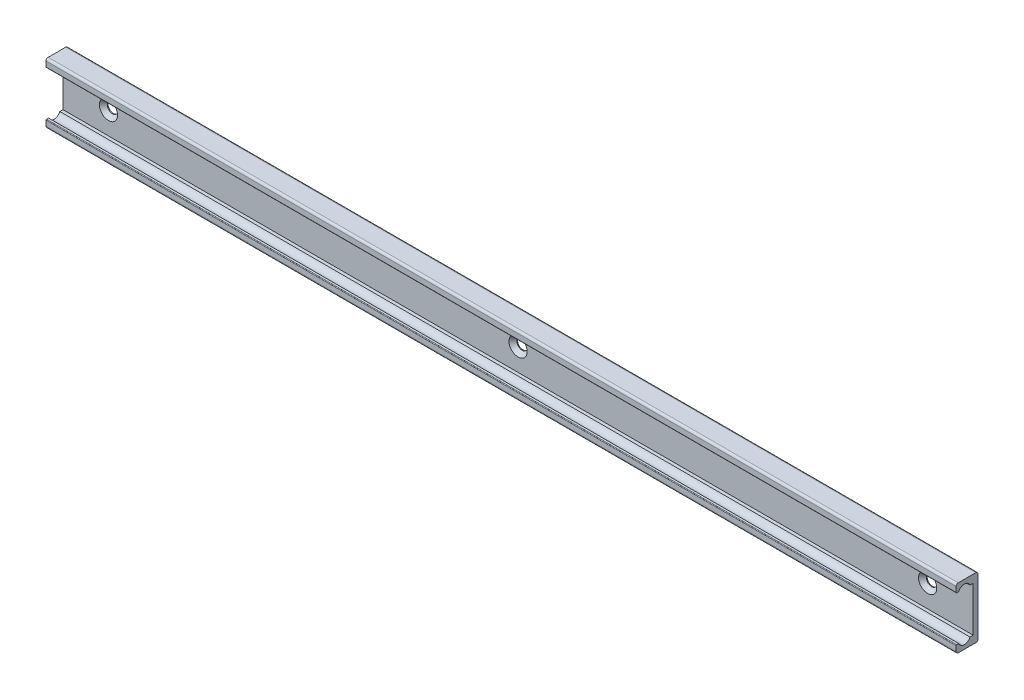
ISO-10303-21;
HEADER;
FILE_DESCRIPTION(('STEP AP214'),'2;1');
FILE_NAME('part.step','',(''),(''),'','','');
FILE_SCHEMA(('AUTOMOTIVE_DESIGN { 1 0 10303 214 1 1 1 1 }'));
ENDSEC;
DATA;
#1=APPLICATION_CONTEXT('core data for automotive mechanical design processes');
#2=APPLICATION_PROTOCOL_DEFINITION('international standard','automotive_design',2000,#1);
#3=PRODUCT_CONTEXT('',#1,'mechanical');
#4=PRODUCT('Part','Part','',(#3));
#5=PRODUCT_RELATED_PRODUCT_CATEGORY('part','',(#4));
#6=PRODUCT_DEFINITION_FORMATION('','',#4);
#7=PRODUCT_DEFINITION_CONTEXT('part definition',#1,'design');
#8=PRODUCT_DEFINITION('design','',#6,#7);
#9=PRODUCT_DEFINITION_SHAPE('','',#8);
#10=(LENGTH_UNIT() NAMED_UNIT(*) SI_UNIT(.MILLI.,.METRE.));
#11=(NAMED_UNIT(*) PLANE_ANGLE_UNIT() SI_UNIT($,.RADIAN.));
#12=(NAMED_UNIT(*) SI_UNIT($,.STERADIAN.) SOLID_ANGLE_UNIT());
#13=UNCERTAINTY_MEASURE_WITH_UNIT(LENGTH_MEASURE(1.E-05),#10,'distance_accuracy_value','');
#14=(GEOMETRIC_REPRESENTATION_CONTEXT(3) GLOBAL_UNCERTAINTY_ASSIGNED_CONTEXT((#13)) GLOBAL_UNIT_ASSIGNED_CONTEXT((#10,
#11,#12)) REPRESENTATION_CONTEXT('',''));
#15=CARTESIAN_POINT('',(0.,0.,0.));
#16=DIRECTION('',(0.,0.,1.));
#17=DIRECTION('',(1.,0.,0.));
#18=AXIS2_PLACEMENT_3D('',#15,#16,#17);
#19=CARTESIAN_POINT('',(285.,9.3,6.49999999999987));
#20=DIRECTION('',(-1.,0.,0.));
#21=DIRECTION('',(0.,0.,1.));
#22=AXIS2_PLACEMENT_3D('',#19,#20,#21);
#23=CYLINDRICAL_SURFACE('',#22,0.7);
#24=CARTESIAN_POINT('',(-15.,9.3,6.49999999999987));
#25=DIRECTION('',(-1.,0.,0.));
#26=DIRECTION('',(0.,0.,-1.));
#27=AXIS2_PLACEMENT_3D('',#24,#25,#26);
#28=CIRCLE('',#27,0.7);
#29=CARTESIAN_POINT('',(-15.,9.3,7.19999999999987));
#30=VERTEX_POINT('',#29);
#31=CARTESIAN_POINT('',(-15.,10.,6.49999999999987));
#32=VERTEX_POINT('',#31);
#33=EDGE_CURVE('E139',#30,#32,#28,.T.);
#34=ORIENTED_EDGE('',*,*,#33,.F.);
#35=DIRECTION('',(-1.,0.,0.));
#36=VECTOR('',#35,1.);
#37=CARTESIAN_POINT('',(285.,9.3,7.19999999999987));
#38=LINE('',#37,#36);
#39=CARTESIAN_POINT('',(285.,9.3,7.19999999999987));
#40=VERTEX_POINT('',#39);
#41=EDGE_CURVE('E9',#40,#30,#38,.T.);
#42=ORIENTED_EDGE('',*,*,#41,.F.);
#43=CARTESIAN_POINT('',(285.,9.3,6.49999999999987));
#44=DIRECTION('',(-1.,0.,0.));
#45=DIRECTION('',(0.,0.,-1.));
#46=AXIS2_PLACEMENT_3D('',#43,#44,#45);
#47=CIRCLE('',#46,0.7);
#48=CARTESIAN_POINT('',(285.,10.,6.49999999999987));
#49=VERTEX_POINT('',#48);
#50=EDGE_CURVE('E141',#40,#49,#47,.T.);
#51=ORIENTED_EDGE('',*,*,#50,.T.);
#52=DIRECTION('',(-1.,0.,0.));
#53=VECTOR('',#52,1.);
#54=CARTESIAN_POINT('',(285.,10.,6.49999999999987));
#55=LINE('',#54,#53);
#56=EDGE_CURVE('E136',#49,#32,#55,.T.);
#57=ORIENTED_EDGE('',*,*,#56,.T.);
#58=EDGE_LOOP('',(#34,#42,#51,#57));
#59=FACE_BOUND('',#58,.T.);
#60=ADVANCED_FACE('F14',(#59),#23,.T.);
#61=CARTESIAN_POINT('',(285.,7.60000008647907,7.19999999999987));
#62=DIRECTION('',(0.,0.,1.));
#63=DIRECTION('',(1.,0.,0.));
#64=AXIS2_PLACEMENT_3D('',#61,#62,#63);
#65=PLANE('',#64);
#66=DIRECTION('',(0.,1.,0.));
#67=VECTOR('',#66,1.);
#68=CARTESIAN_POINT('',(-15.,7.60000008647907,7.19999999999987));
#69=LINE('',#68,#67);
#70=CARTESIAN_POINT('',(-15.,7.60000008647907,7.19999999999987));
#71=VERTEX_POINT('',#70);
#72=EDGE_CURVE('E158',#71,#30,#69,.T.);
#73=ORIENTED_EDGE('',*,*,#72,.F.);
#74=DIRECTION('',(-1.,0.,0.));
#75=VECTOR('',#74,1.);
#76=CARTESIAN_POINT('',(285.,7.60000008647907,7.19999999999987));
#77=LINE('',#76,#75);
#78=CARTESIAN_POINT('',(285.,7.60000008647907,7.19999999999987));
#79=VERTEX_POINT('',#78);
#80=EDGE_CURVE('E22',#79,#71,#77,.T.);
#81=ORIENTED_EDGE('',*,*,#80,.F.);
#82=DIRECTION('',(0.,1.,0.));
#83=VECTOR('',#82,1.);
#84=CARTESIAN_POINT('',(285.,7.60000008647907,7.19999999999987));
#85=LINE('',#84,#83);
#86=EDGE_CURVE('E146',#79,#40,#85,.T.);
#87=ORIENTED_EDGE('',*,*,#86,.T.);
#88=ORIENTED_EDGE('',*,*,#41,.T.);
#89=EDGE_LOOP('',(#73,#81,#87,#88));
#90=FACE_BOUND('',#89,.T.);
#91=ADVANCED_FACE('F386',(#90),#65,.T.);
#92=CARTESIAN_POINT('',(285.,7.60000008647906,6.99999999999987));
#93=DIRECTION('',(-1.,0.,0.));
#94=DIRECTION('',(0.,0.,1.));
#95=AXIS2_PLACEMENT_3D('',#92,#93,#94);
#96=CYLINDRICAL_SURFACE('',#95,0.2);
#97=CARTESIAN_POINT('',(-15.,7.60000008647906,6.99999999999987));
#98=DIRECTION('',(-1.,0.,0.));
#99=DIRECTION('',(0.,0.,-1.));
#100=AXIS2_PLACEMENT_3D('',#97,#98,#99);
#101=CIRCLE('',#100,0.2);
#102=CARTESIAN_POINT('',(-15.,7.40000008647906,6.99999999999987));
#103=VERTEX_POINT('',#102);
#104=EDGE_CURVE('E206',#103,#71,#101,.T.);
#105=ORIENTED_EDGE('',*,*,#104,.F.);
#106=DIRECTION('',(-1.,0.,0.));
#107=VECTOR('',#106,1.);
#108=CARTESIAN_POINT('',(285.,7.40000008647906,6.99999999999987));
#109=LINE('',#108,#107);
#110=CARTESIAN_POINT('',(285.,7.40000008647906,6.99999999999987));
#111=VERTEX_POINT('',#110);
#112=EDGE_CURVE('E258',#111,#103,#109,.T.);
#113=ORIENTED_EDGE('',*,*,#112,.F.);
#114=CARTESIAN_POINT('',(285.,7.60000008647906,6.99999999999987));
#115=DIRECTION('',(-1.,0.,0.));
#116=DIRECTION('',(0.,0.,-1.));
#117=AXIS2_PLACEMENT_3D('',#114,#115,#116);
#118=CIRCLE('',#117,0.2);
#119=EDGE_CURVE('E254',#111,#79,#118,.T.);
#120=ORIENTED_EDGE('',*,*,#119,.T.);
#121=ORIENTED_EDGE('',*,*,#80,.T.);
#122=EDGE_LOOP('',(#105,#113,#120,#121));
#123=FACE_BOUND('',#122,.T.);
#124=ADVANCED_FACE('F391',(#123),#96,.T.);
#125=CARTESIAN_POINT('',(285.,7.40000008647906,6.35404949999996));
#126=DIRECTION('',(0.,-1.,0.));
#127=DIRECTION('',(1.,0.,0.));
#128=AXIS2_PLACEMENT_3D('',#125,#126,#127);
#129=PLANE('',#128);
#130=DIRECTION('',(0.,0.,1.));
#131=VECTOR('',#130,1.);
#132=CARTESIAN_POINT('',(-15.,7.40000008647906,6.35404949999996));
#133=LINE('',#132,#131);
#134=CARTESIAN_POINT('',(-15.,7.40000008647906,6.35404949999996));
#135=VERTEX_POINT('',#134);
#136=EDGE_CURVE('E203',#135,#103,#133,.T.);
#137=ORIENTED_EDGE('',*,*,#136,.F.);
#138=DIRECTION('',(-1.,0.,0.));
#139=VECTOR('',#138,1.);
#140=CARTESIAN_POINT('',(285.,7.40000008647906,6.35404949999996));
#141=LINE('',#140,#139);
#142=CARTESIAN_POINT('',(285.,7.40000008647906,6.35404949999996));
#143=VERTEX_POINT('',#142);
#144=EDGE_CURVE('E260',#143,#135,#141,.T.);
#145=ORIENTED_EDGE('',*,*,#144,.F.);
#146=DIRECTION('',(0.,0.,1.));
#147=VECTOR('',#146,1.);
#148=CARTESIAN_POINT('',(285.,7.40000008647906,6.35404949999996));
#149=LINE('',#148,#147);
#150=EDGE_CURVE('E251',#143,#111,#149,.T.);
#151=ORIENTED_EDGE('',*,*,#150,.T.);
#152=ORIENTED_EDGE('',*,*,#112,.T.);
#153=EDGE_LOOP('',(#137,#145,#151,#152));
#154=FACE_BOUND('',#153,.T.);
#155=ADVANCED_FACE('F397',(#154),#129,.T.);
#156=CARTESIAN_POINT('',(285.,6.65000008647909,4.50000000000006));
#157=DIRECTION('',(-1.,0.,0.));
#158=DIRECTION('',(0.,0.,1.));
#159=AXIS2_PLACEMENT_3D('',#156,#157,#158);
#160=CYLINDRICAL_SURFACE('',#159,1.99999988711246);
#161=CARTESIAN_POINT('',(-15.,6.65000008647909,4.50000000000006));
#162=DIRECTION('',(1.,0.,0.));
#163=DIRECTION('',(0.,0.,1.));
#164=AXIS2_PLACEMENT_3D('',#161,#162,#163);
#165=CIRCLE('',#164,1.99999988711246);
#166=CARTESIAN_POINT('',(-15.,7.40000008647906,2.64595050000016));
#167=VERTEX_POINT('',#166);
#168=EDGE_CURVE('E200',#167,#135,#165,.T.);
#169=ORIENTED_EDGE('',*,*,#168,.F.);
#170=DIRECTION('',(-1.,0.,0.));
#171=VECTOR('',#170,1.);
#172=CARTESIAN_POINT('',(285.,7.40000008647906,2.64595050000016));
#173=LINE('',#172,#171);
#174=CARTESIAN_POINT('',(285.,7.40000008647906,2.64595050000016));
#175=VERTEX_POINT('',#174);
#176=EDGE_CURVE('E262',#175,#167,#173,.T.);
#177=ORIENTED_EDGE('',*,*,#176,.F.);
#178=CARTESIAN_POINT('',(285.,6.65000008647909,4.50000000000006));
#179=DIRECTION('',(1.,0.,0.));
#180=DIRECTION('',(0.,0.,1.));
#181=AXIS2_PLACEMENT_3D('',#178,#179,#180);
#182=CIRCLE('',#181,1.99999988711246);
#183=EDGE_CURVE('E248',#175,#143,#182,.T.);
#184=ORIENTED_EDGE('',*,*,#183,.T.);
#185=ORIENTED_EDGE('',*,*,#144,.T.);
#186=EDGE_LOOP('',(#169,#177,#184,#185));
#187=FACE_BOUND('',#186,.T.);
#188=ADVANCED_FACE('F405',(#187),#160,.F.);
#189=CARTESIAN_POINT('',(285.,7.40000008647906,1.60000000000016));
#190=DIRECTION('',(0.,-1.,0.));
#191=DIRECTION('',(1.,0.,0.));
#192=AXIS2_PLACEMENT_3D('',#189,#190,#191);
#193=PLANE('',#192);
#194=DIRECTION('',(0.,0.,1.));
#195=VECTOR('',#194,1.);
#196=CARTESIAN_POINT('',(-15.,7.40000008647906,1.60000000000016));
#197=LINE('',#196,#195);
#198=CARTESIAN_POINT('',(-15.,7.40000008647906,1.60000000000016));
#199=VERTEX_POINT('',#198);
#200=EDGE_CURVE('E197',#199,#167,#197,.T.);
#201=ORIENTED_EDGE('',*,*,#200,.F.);
#202=DIRECTION('',(-1.,0.,0.));
#203=VECTOR('',#202,1.);
#204=CARTESIAN_POINT('',(285.,7.40000008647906,1.60000000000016));
#205=LINE('',#204,#203);
#206=CARTESIAN_POINT('',(285.,7.40000008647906,1.60000000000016));
#207=VERTEX_POINT('',#206);
#208=EDGE_CURVE('E264',#207,#199,#205,.T.);
#209=ORIENTED_EDGE('',*,*,#208,.F.);
#210=DIRECTION('',(0.,0.,1.));
#211=VECTOR('',#210,1.);
#212=CARTESIAN_POINT('',(285.,7.40000008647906,1.60000000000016));
#213=LINE('',#212,#211);
#214=EDGE_CURVE('E245',#207,#175,#213,.T.);
#215=ORIENTED_EDGE('',*,*,#214,.T.);
#216=ORIENTED_EDGE('',*,*,#176,.T.);
#217=EDGE_LOOP('',(#201,#209,#215,#216));
#218=FACE_BOUND('',#217,.T.);
#219=ADVANCED_FACE('F330',(#218),#193,.T.);
#220=CARTESIAN_POINT('',(285.,-7.40000008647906,1.60000000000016));
#221=DIRECTION('',(0.,0.,1.));
#222=DIRECTION('',(0.,1.,0.));
#223=AXIS2_PLACEMENT_3D('',#220,#221,#222);
#224=PLANE('',#223);
#225=CARTESIAN_POINT('',(270.,0.,1.60000000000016));
#226=DIRECTION('',(0.,0.,1.));
#227=DIRECTION('',(0.,1.,0.));
#228=AXIS2_PLACEMENT_3D('',#225,#226,#227);
#229=CIRCLE('',#228,3.);
#230=CARTESIAN_POINT('',(270.,3.,1.60000000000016));
#231=VERTEX_POINT('',#230);
#232=EDGE_CURVE('E291',#231,#231,#229,.T.);
#233=ORIENTED_EDGE('',*,*,#232,.F.);
#234=EDGE_LOOP('',(#233));
#235=FACE_BOUND('',#234,.T.);
#236=CARTESIAN_POINT('',(135.,0.,1.60000000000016));
#237=DIRECTION('',(0.,0.,1.));
#238=DIRECTION('',(0.,1.,0.));
#239=AXIS2_PLACEMENT_3D('',#236,#237,#238);
#240=CIRCLE('',#239,3.);
#241=CARTESIAN_POINT('',(135.,3.,1.60000000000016));
#242=VERTEX_POINT('',#241);
#243=EDGE_CURVE('E296',#242,#242,#240,.T.);
#244=ORIENTED_EDGE('',*,*,#243,.F.);
#245=EDGE_LOOP('',(#244));
#246=FACE_BOUND('',#245,.T.);
#247=CARTESIAN_POINT('',(0.,0.,1.60000000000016));
#248=DIRECTION('',(0.,0.,1.));
#249=DIRECTION('',(0.,1.,0.));
#250=AXIS2_PLACEMENT_3D('',#247,#248,#249);
#251=CIRCLE('',#250,3.);
#252=CARTESIAN_POINT('',(0.,3.,1.60000000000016));
#253=VERTEX_POINT('',#252);
#254=EDGE_CURVE('E159',#253,#253,#251,.T.);
#255=ORIENTED_EDGE('',*,*,#254,.F.);
#256=EDGE_LOOP('',(#255));
#257=FACE_BOUND('',#256,.T.);
#258=DIRECTION('',(0.,1.,0.));
#259=VECTOR('',#258,1.);
#260=CARTESIAN_POINT('',(-15.,-7.40000008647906,1.60000000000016));
#261=LINE('',#260,#259);
#262=CARTESIAN_POINT('',(-15.,-7.40000008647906,1.60000000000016));
#263=VERTEX_POINT('',#262);
#264=EDGE_CURVE('E194',#263,#199,#261,.T.);
#265=ORIENTED_EDGE('',*,*,#264,.F.);
#266=DIRECTION('',(-1.,0.,0.));
#267=VECTOR('',#266,1.);
#268=CARTESIAN_POINT('',(285.,-7.40000008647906,1.60000000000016));
#269=LINE('',#268,#267);
#270=CARTESIAN_POINT('',(285.,-7.40000008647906,1.60000000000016));
#271=VERTEX_POINT('',#270);
#272=EDGE_CURVE('E266',#271,#263,#269,.T.);
#273=ORIENTED_EDGE('',*,*,#272,.F.);
#274=DIRECTION('',(0.,1.,0.));
#275=VECTOR('',#274,1.);
#276=CARTESIAN_POINT('',(285.,-7.40000008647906,1.60000000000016));
#277=LINE('',#276,#275);
#278=EDGE_CURVE('E242',#271,#207,#277,.T.);
#279=ORIENTED_EDGE('',*,*,#278,.T.);
#280=ORIENTED_EDGE('',*,*,#208,.T.);
#281=EDGE_LOOP('',(#265,#273,#279,#280));
#282=FACE_BOUND('',#281,.T.);
#283=ADVANCED_FACE('F326',(#235,#246,#257,#282),#224,.T.);
#284=CARTESIAN_POINT('',(285.,-7.40000008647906,1.60000000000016));
#285=DIRECTION('',(0.,1.,0.));
#286=DIRECTION('',(-1.,0.,0.));
#287=AXIS2_PLACEMENT_3D('',#284,#285,#286);
#288=PLANE('',#287);
#289=DIRECTION('',(0.,0.,-1.));
#290=VECTOR('',#289,1.);
#291=CARTESIAN_POINT('',(-15.,-7.40000008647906,1.60000000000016));
#292=LINE('',#291,#290);
#293=CARTESIAN_POINT('',(-15.,-7.40000008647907,2.64595050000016));
#294=VERTEX_POINT('',#293);
#295=EDGE_CURVE('E191',#294,#263,#292,.T.);
#296=ORIENTED_EDGE('',*,*,#295,.F.);
#297=DIRECTION('',(-1.,0.,0.));
#298=VECTOR('',#297,1.);
#299=CARTESIAN_POINT('',(285.,-7.40000008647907,2.64595050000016));
#300=LINE('',#299,#298);
#301=CARTESIAN_POINT('',(285.,-7.40000008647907,2.64595050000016));
#302=VERTEX_POINT('',#301);
#303=EDGE_CURVE('E268',#302,#294,#300,.T.);
#304=ORIENTED_EDGE('',*,*,#303,.F.);
#305=DIRECTION('',(0.,0.,-1.));
#306=VECTOR('',#305,1.);
#307=CARTESIAN_POINT('',(285.,-7.40000008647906,1.60000000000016));
#308=LINE('',#307,#306);
#309=EDGE_CURVE('E239',#302,#271,#308,.T.);
#310=ORIENTED_EDGE('',*,*,#309,.T.);
#311=ORIENTED_EDGE('',*,*,#272,.T.);
#312=EDGE_LOOP('',(#296,#304,#310,#311));
#313=FACE_BOUND('',#312,.T.);
#314=ADVANCED_FACE('F329',(#313),#288,.T.);
#315=CARTESIAN_POINT('',(285.,-6.65000008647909,4.50000000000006));
#316=DIRECTION('',(-1.,0.,0.));
#317=DIRECTION('',(0.,0.,1.));
#318=AXIS2_PLACEMENT_3D('',#315,#316,#317);
#319=CYLINDRICAL_SURFACE('',#318,1.99999988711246);
#320=CARTESIAN_POINT('',(-15.,-6.65000008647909,4.50000000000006));
#321=DIRECTION('',(1.,0.,0.));
#322=DIRECTION('',(0.,0.,-1.));
#323=AXIS2_PLACEMENT_3D('',#320,#321,#322);
#324=CIRCLE('',#323,1.99999988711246);
#325=CARTESIAN_POINT('',(-15.,-7.40000008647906,6.35404949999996));
#326=VERTEX_POINT('',#325);
#327=EDGE_CURVE('E188',#326,#294,#324,.T.);
#328=ORIENTED_EDGE('',*,*,#327,.F.);
#329=DIRECTION('',(-1.,0.,0.));
#330=VECTOR('',#329,1.);
#331=CARTESIAN_POINT('',(285.,-7.40000008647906,6.35404949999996));
#332=LINE('',#331,#330);
#333=CARTESIAN_POINT('',(285.,-7.40000008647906,6.35404949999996));
#334=VERTEX_POINT('',#333);
#335=EDGE_CURVE('E270',#334,#326,#332,.T.);
#336=ORIENTED_EDGE('',*,*,#335,.F.);
#337=CARTESIAN_POINT('',(285.,-6.65000008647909,4.50000000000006));
#338=DIRECTION('',(1.,0.,0.));
#339=DIRECTION('',(0.,0.,-1.));
#340=AXIS2_PLACEMENT_3D('',#337,#338,#339);
#341=CIRCLE('',#340,1.99999988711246);
#342=EDGE_CURVE('E236',#334,#302,#341,.T.);
#343=ORIENTED_EDGE('',*,*,#342,.T.);
#344=ORIENTED_EDGE('',*,*,#303,.T.);
#345=EDGE_LOOP('',(#328,#336,#343,#344));
#346=FACE_BOUND('',#345,.T.);
#347=ADVANCED_FACE('F346',(#346),#319,.F.);
#348=CARTESIAN_POINT('',(285.,-7.40000008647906,6.35404949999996));
#349=DIRECTION('',(0.,1.,0.));
#350=DIRECTION('',(-1.,0.,0.));
#351=AXIS2_PLACEMENT_3D('',#348,#349,#350);
#352=PLANE('',#351);
#353=DIRECTION('',(0.,0.,-1.));
#354=VECTOR('',#353,1.);
#355=CARTESIAN_POINT('',(-15.,-7.40000008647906,6.35404949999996));
#356=LINE('',#355,#354);
#357=CARTESIAN_POINT('',(-15.,-7.40000008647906,6.99999999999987));
#358=VERTEX_POINT('',#357);
#359=EDGE_CURVE('E185',#358,#326,#356,.T.);
#360=ORIENTED_EDGE('',*,*,#359,.F.);
#361=DIRECTION('',(-1.,0.,0.));
#362=VECTOR('',#361,1.);
#363=CARTESIAN_POINT('',(285.,-7.40000008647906,6.99999999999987));
#364=LINE('',#363,#362);
#365=CARTESIAN_POINT('',(285.,-7.40000008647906,6.99999999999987));
#366=VERTEX_POINT('',#365);
#367=EDGE_CURVE('E272',#366,#358,#364,.T.);
#368=ORIENTED_EDGE('',*,*,#367,.F.);
#369=DIRECTION('',(0.,0.,-1.));
#370=VECTOR('',#369,1.);
#371=CARTESIAN_POINT('',(285.,-7.40000008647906,6.35404949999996));
#372=LINE('',#371,#370);
#373=EDGE_CURVE('E233',#366,#334,#372,.T.);
#374=ORIENTED_EDGE('',*,*,#373,.T.);
#375=ORIENTED_EDGE('',*,*,#335,.T.);
#376=EDGE_LOOP('',(#360,#368,#374,#375));
#377=FACE_BOUND('',#376,.T.);
#378=ADVANCED_FACE('F349',(#377),#352,.T.);
#379=CARTESIAN_POINT('',(285.,-7.60000008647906,6.99999999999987));
#380=DIRECTION('',(-1.,0.,0.));
#381=DIRECTION('',(0.,0.,1.));
#382=AXIS2_PLACEMENT_3D('',#379,#380,#381);
#383=CYLINDRICAL_SURFACE('',#382,0.2);
#384=CARTESIAN_POINT('',(-15.,-7.60000008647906,6.99999999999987));
#385=DIRECTION('',(-1.,0.,0.));
#386=DIRECTION('',(0.,0.,1.));
#387=AXIS2_PLACEMENT_3D('',#384,#385,#386);
#388=CIRCLE('',#387,0.2);
#389=CARTESIAN_POINT('',(-15.,-7.60000008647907,7.19999999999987));
#390=VERTEX_POINT('',#389);
#391=EDGE_CURVE('E182',#390,#358,#388,.T.);
#392=ORIENTED_EDGE('',*,*,#391,.F.);
#393=DIRECTION('',(-1.,0.,0.));
#394=VECTOR('',#393,1.);
#395=CARTESIAN_POINT('',(285.,-7.60000008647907,7.19999999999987));
#396=LINE('',#395,#394);
#397=CARTESIAN_POINT('',(285.,-7.60000008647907,7.19999999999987));
#398=VERTEX_POINT('',#397);
#399=EDGE_CURVE('E274',#398,#390,#396,.T.);
#400=ORIENTED_EDGE('',*,*,#399,.F.);
#401=CARTESIAN_POINT('',(285.,-7.60000008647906,6.99999999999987));
#402=DIRECTION('',(-1.,0.,0.));
#403=DIRECTION('',(0.,0.,1.));
#404=AXIS2_PLACEMENT_3D('',#401,#402,#403);
#405=CIRCLE('',#404,0.2);
#406=EDGE_CURVE('E230',#398,#366,#405,.T.);
#407=ORIENTED_EDGE('',*,*,#406,.T.);
#408=ORIENTED_EDGE('',*,*,#367,.T.);
#409=EDGE_LOOP('',(#392,#400,#407,#408));
#410=FACE_BOUND('',#409,.T.);
#411=ADVANCED_FACE('F354',(#410),#383,.T.);
#412=CARTESIAN_POINT('',(285.,-7.60000008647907,7.19999999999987));
#413=DIRECTION('',(0.,0.,1.));
#414=DIRECTION('',(1.,0.,0.));
#415=AXIS2_PLACEMENT_3D('',#412,#413,#414);
#416=PLANE('',#415);
#417=DIRECTION('',(0.,1.,0.));
#418=VECTOR('',#417,1.);
#419=CARTESIAN_POINT('',(-15.,-7.60000008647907,7.19999999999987));
#420=LINE('',#419,#418);
#421=CARTESIAN_POINT('',(-15.,-9.3,7.19999999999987));
#422=VERTEX_POINT('',#421);
#423=EDGE_CURVE('E179',#422,#390,#420,.T.);
#424=ORIENTED_EDGE('',*,*,#423,.F.);
#425=DIRECTION('',(-1.,0.,0.));
#426=VECTOR('',#425,1.);
#427=CARTESIAN_POINT('',(285.,-9.3,7.19999999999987));
#428=LINE('',#427,#426);
#429=CARTESIAN_POINT('',(285.,-9.3,7.19999999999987));
#430=VERTEX_POINT('',#429);
#431=EDGE_CURVE('E276',#430,#422,#428,.T.);
#432=ORIENTED_EDGE('',*,*,#431,.F.);
#433=DIRECTION('',(0.,1.,0.));
#434=VECTOR('',#433,1.);
#435=CARTESIAN_POINT('',(285.,-7.60000008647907,7.19999999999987));
#436=LINE('',#435,#434);
#437=EDGE_CURVE('E227',#430,#398,#436,.T.);
#438=ORIENTED_EDGE('',*,*,#437,.T.);
#439=ORIENTED_EDGE('',*,*,#399,.T.);
#440=EDGE_LOOP('',(#424,#432,#438,#439));
#441=FACE_BOUND('',#440,.T.);
#442=ADVANCED_FACE('F357',(#441),#416,.T.);
#443=CARTESIAN_POINT('',(285.,-9.3,6.49999999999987));
#444=DIRECTION('',(-1.,0.,0.));
#445=DIRECTION('',(0.,0.,1.));
#446=AXIS2_PLACEMENT_3D('',#443,#444,#445);
#447=CYLINDRICAL_SURFACE('',#446,0.7);
#448=CARTESIAN_POINT('',(-15.,-9.3,6.49999999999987));
#449=DIRECTION('',(-1.,0.,0.));
#450=DIRECTION('',(0.,0.,1.));
#451=AXIS2_PLACEMENT_3D('',#448,#449,#450);
#452=CIRCLE('',#451,0.7);
#453=CARTESIAN_POINT('',(-15.,-10.,6.49999999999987));
#454=VERTEX_POINT('',#453);
#455=EDGE_CURVE('E176',#454,#422,#452,.T.);
#456=ORIENTED_EDGE('',*,*,#455,.F.);
#457=DIRECTION('',(-1.,0.,0.));
#458=VECTOR('',#457,1.);
#459=CARTESIAN_POINT('',(285.,-10.,6.49999999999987));
#460=LINE('',#459,#458);
#461=CARTESIAN_POINT('',(285.,-10.,6.49999999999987));
#462=VERTEX_POINT('',#461);
#463=EDGE_CURVE('E278',#462,#454,#460,.T.);
#464=ORIENTED_EDGE('',*,*,#463,.F.);
#465=CARTESIAN_POINT('',(285.,-9.3,6.49999999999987));
#466=DIRECTION('',(-1.,0.,0.));
#467=DIRECTION('',(0.,0.,1.));
#468=AXIS2_PLACEMENT_3D('',#465,#466,#467);
#469=CIRCLE('',#468,0.7);
#470=EDGE_CURVE('E224',#462,#430,#469,.T.);
#471=ORIENTED_EDGE('',*,*,#470,.T.);
#472=ORIENTED_EDGE('',*,*,#431,.T.);
#473=EDGE_LOOP('',(#456,#464,#471,#472));
#474=FACE_BOUND('',#473,.T.);
#475=ADVANCED_FACE('F362',(#474),#447,.T.);
#476=CARTESIAN_POINT('',(285.,-10.,0.7));
#477=DIRECTION('',(0.,-1.,0.));
#478=DIRECTION('',(1.,0.,0.));
#479=AXIS2_PLACEMENT_3D('',#476,#477,#478);
#480=PLANE('',#479);
#481=DIRECTION('',(0.,0.,1.));
#482=VECTOR('',#481,1.);
#483=CARTESIAN_POINT('',(-15.,-10.,0.7));
#484=LINE('',#483,#482);
#485=CARTESIAN_POINT('',(-15.,-10.,0.7));
#486=VERTEX_POINT('',#485);
#487=EDGE_CURVE('E173',#486,#454,#484,.T.);
#488=ORIENTED_EDGE('',*,*,#487,.F.);
#489=DIRECTION('',(-1.,0.,0.));
#490=VECTOR('',#489,1.);
#491=CARTESIAN_POINT('',(285.,-10.,0.7));
#492=LINE('',#491,#490);
#493=CARTESIAN_POINT('',(285.,-10.,0.7));
#494=VERTEX_POINT('',#493);
#495=EDGE_CURVE('E280',#494,#486,#492,.T.);
#496=ORIENTED_EDGE('',*,*,#495,.F.);
#497=DIRECTION('',(0.,0.,1.));
#498=VECTOR('',#497,1.);
#499=CARTESIAN_POINT('',(285.,-10.,0.7));
#500=LINE('',#499,#498);
#501=EDGE_CURVE('E221',#494,#462,#500,.T.);
#502=ORIENTED_EDGE('',*,*,#501,.T.);
#503=ORIENTED_EDGE('',*,*,#463,.T.);
#504=EDGE_LOOP('',(#488,#496,#502,#503));
#505=FACE_BOUND('',#504,.T.);
#506=ADVANCED_FACE('F365',(#505),#480,.T.);
#507=CARTESIAN_POINT('',(285.,-9.3,0.7));
#508=DIRECTION('',(-1.,0.,0.));
#509=DIRECTION('',(0.,0.,1.));
#510=AXIS2_PLACEMENT_3D('',#507,#508,#509);
#511=CYLINDRICAL_SURFACE('',#510,0.7);
#512=CARTESIAN_POINT('',(-15.,-9.3,0.7));
#513=DIRECTION('',(-1.,0.,0.));
#514=DIRECTION('',(0.,0.,1.));
#515=AXIS2_PLACEMENT_3D('',#512,#513,#514);
#516=CIRCLE('',#515,0.7);
#517=CARTESIAN_POINT('',(-15.,-9.3,0.));
#518=VERTEX_POINT('',#517);
#519=EDGE_CURVE('E170',#518,#486,#516,.T.);
#520=ORIENTED_EDGE('',*,*,#519,.F.);
#521=DIRECTION('',(-1.,0.,0.));
#522=VECTOR('',#521,1.);
#523=CARTESIAN_POINT('',(285.,-9.3,0.));
#524=LINE('',#523,#522);
#525=CARTESIAN_POINT('',(285.,-9.3,0.));
#526=VERTEX_POINT('',#525);
#527=EDGE_CURVE('E282',#526,#518,#524,.T.);
#528=ORIENTED_EDGE('',*,*,#527,.F.);
#529=CARTESIAN_POINT('',(285.,-9.3,0.7));
#530=DIRECTION('',(-1.,0.,0.));
#531=DIRECTION('',(0.,0.,1.));
#532=AXIS2_PLACEMENT_3D('',#529,#530,#531);
#533=CIRCLE('',#532,0.7);
#534=EDGE_CURVE('E218',#526,#494,#533,.T.);
#535=ORIENTED_EDGE('',*,*,#534,.T.);
#536=ORIENTED_EDGE('',*,*,#495,.T.);
#537=EDGE_LOOP('',(#520,#528,#535,#536));
#538=FACE_BOUND('',#537,.T.);
#539=ADVANCED_FACE('F370',(#538),#511,.T.);
#540=CARTESIAN_POINT('',(285.,-9.3,0.));
#541=DIRECTION('',(0.,0.,-1.));
#542=DIRECTION('',(-1.,0.,0.));
#543=AXIS2_PLACEMENT_3D('',#540,#541,#542);
#544=PLANE('',#543);
#545=CARTESIAN_POINT('',(270.,0.,0.));
#546=DIRECTION('',(0.,0.,1.));
#547=DIRECTION('',(0.,1.,0.));
#548=AXIS2_PLACEMENT_3D('',#545,#546,#547);
#549=CIRCLE('',#548,1.75);
#550=CARTESIAN_POINT('',(270.,1.75,0.));
#551=VERTEX_POINT('',#550);
#552=EDGE_CURVE('E303',#551,#551,#549,.T.);
#553=ORIENTED_EDGE('',*,*,#552,.T.);
#554=EDGE_LOOP('',(#553));
#555=FACE_BOUND('',#554,.T.);
#556=CARTESIAN_POINT('',(135.,0.,0.));
#557=DIRECTION('',(0.,0.,1.));
#558=DIRECTION('',(0.,1.,0.));
#559=AXIS2_PLACEMENT_3D('',#556,#557,#558);
#560=CIRCLE('',#559,1.75);
#561=CARTESIAN_POINT('',(135.,1.75,0.));
#562=VERTEX_POINT('',#561);
#563=EDGE_CURVE('E292',#562,#562,#560,.T.);
#564=ORIENTED_EDGE('',*,*,#563,.T.);
#565=EDGE_LOOP('',(#564));
#566=FACE_BOUND('',#565,.T.);
#567=CARTESIAN_POINT('',(0.,0.,0.));
#568=DIRECTION('',(0.,0.,1.));
#569=DIRECTION('',(0.,1.,0.));
#570=AXIS2_PLACEMENT_3D('',#567,#568,#569);
#571=CIRCLE('',#570,1.75);
#572=CARTESIAN_POINT('',(0.,1.75,0.));
#573=VERTEX_POINT('',#572);
#574=EDGE_CURVE('E288',#573,#573,#571,.T.);
#575=ORIENTED_EDGE('',*,*,#574,.T.);
#576=EDGE_LOOP('',(#575));
#577=FACE_BOUND('',#576,.T.);
#578=DIRECTION('',(0.,-1.,0.));
#579=VECTOR('',#578,1.);
#580=CARTESIAN_POINT('',(-15.,-9.3,0.));
#581=LINE('',#580,#579);
#582=CARTESIAN_POINT('',(-15.,9.3,0.));
#583=VERTEX_POINT('',#582);
#584=EDGE_CURVE('E167',#583,#518,#581,.T.);
#585=ORIENTED_EDGE('',*,*,#584,.F.);
#586=DIRECTION('',(-1.,0.,0.));
#587=VECTOR('',#586,1.);
#588=CARTESIAN_POINT('',(285.,9.3,0.));
#589=LINE('',#588,#587);
#590=CARTESIAN_POINT('',(285.,9.3,0.));
#591=VERTEX_POINT('',#590);
#592=EDGE_CURVE('E284',#591,#583,#589,.T.);
#593=ORIENTED_EDGE('',*,*,#592,.F.);
#594=DIRECTION('',(0.,-1.,0.));
#595=VECTOR('',#594,1.);
#596=CARTESIAN_POINT('',(285.,-9.3,0.));
#597=LINE('',#596,#595);
#598=EDGE_CURVE('E215',#591,#526,#597,.T.);
#599=ORIENTED_EDGE('',*,*,#598,.T.);
#600=ORIENTED_EDGE('',*,*,#527,.T.);
#601=EDGE_LOOP('',(#585,#593,#599,#600));
#602=FACE_BOUND('',#601,.T.);
#603=ADVANCED_FACE('F310',(#555,#566,#577,#602),#544,.T.);
#604=CARTESIAN_POINT('',(285.,9.3,0.7));
#605=DIRECTION('',(-1.,0.,0.));
#606=DIRECTION('',(0.,0.,1.));
#607=AXIS2_PLACEMENT_3D('',#604,#605,#606);
#608=CYLINDRICAL_SURFACE('',#607,0.7);
#609=CARTESIAN_POINT('',(-15.,9.3,0.7));
#610=DIRECTION('',(-1.,0.,0.));
#611=DIRECTION('',(0.,0.,-1.));
#612=AXIS2_PLACEMENT_3D('',#609,#610,#611);
#613=CIRCLE('',#612,0.7);
#614=CARTESIAN_POINT('',(-15.,10.,0.7));
#615=VERTEX_POINT('',#614);
#616=EDGE_CURVE('E154',#615,#583,#613,.T.);
#617=ORIENTED_EDGE('',*,*,#616,.F.);
#618=DIRECTION('',(-1.,0.,0.));
#619=VECTOR('',#618,1.);
#620=CARTESIAN_POINT('',(285.,10.,0.7));
#621=LINE('',#620,#619);
#622=CARTESIAN_POINT('',(285.,10.,0.7));
#623=VERTEX_POINT('',#622);
#624=EDGE_CURVE('E145',#623,#615,#621,.T.);
#625=ORIENTED_EDGE('',*,*,#624,.F.);
#626=CARTESIAN_POINT('',(285.,9.3,0.7));
#627=DIRECTION('',(-1.,0.,0.));
#628=DIRECTION('',(0.,0.,-1.));
#629=AXIS2_PLACEMENT_3D('',#626,#627,#628);
#630=CIRCLE('',#629,0.7);
#631=EDGE_CURVE('E212',#623,#591,#630,.T.);
#632=ORIENTED_EDGE('',*,*,#631,.T.);
#633=ORIENTED_EDGE('',*,*,#592,.T.);
#634=EDGE_LOOP('',(#617,#625,#632,#633));
#635=FACE_BOUND('',#634,.T.);
#636=ADVANCED_FACE('F374',(#635),#608,.T.);
#637=CARTESIAN_POINT('',(285.,10.,0.7));
#638=DIRECTION('',(0.,1.,0.));
#639=DIRECTION('',(-1.,0.,0.));
#640=AXIS2_PLACEMENT_3D('',#637,#638,#639);
#641=PLANE('',#640);
#642=DIRECTION('',(0.,0.,-1.));
#643=VECTOR('',#642,1.);
#644=CARTESIAN_POINT('',(-15.,10.,0.7));
#645=LINE('',#644,#643);
#646=EDGE_CURVE('E149',#32,#615,#645,.T.);
#647=ORIENTED_EDGE('',*,*,#646,.F.);
#648=ORIENTED_EDGE('',*,*,#56,.F.);
#649=DIRECTION('',(0.,0.,-1.));
#650=VECTOR('',#649,1.);
#651=CARTESIAN_POINT('',(285.,10.,0.7));
#652=LINE('',#651,#650);
#653=EDGE_CURVE('E210',#49,#623,#652,.T.);
#654=ORIENTED_EDGE('',*,*,#653,.T.);
#655=ORIENTED_EDGE('',*,*,#624,.T.);
#656=EDGE_LOOP('',(#647,#648,#654,#655));
#657=FACE_BOUND('',#656,.T.);
#658=ADVANCED_FACE('F150',(#657),#641,.T.);
#659=CARTESIAN_POINT('',(285.,9.3,6.49999999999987));
#660=DIRECTION('',(1.,0.,0.));
#661=DIRECTION('',(0.,0.,-1.));
#662=AXIS2_PLACEMENT_3D('',#659,#660,#661);
#663=PLANE('',#662);
#664=ORIENTED_EDGE('',*,*,#50,.F.);
#665=ORIENTED_EDGE('',*,*,#86,.F.);
#666=ORIENTED_EDGE('',*,*,#119,.F.);
#667=ORIENTED_EDGE('',*,*,#150,.F.);
#668=ORIENTED_EDGE('',*,*,#183,.F.);
#669=ORIENTED_EDGE('',*,*,#214,.F.);
#670=ORIENTED_EDGE('',*,*,#278,.F.);
#671=ORIENTED_EDGE('',*,*,#309,.F.);
#672=ORIENTED_EDGE('',*,*,#342,.F.);
#673=ORIENTED_EDGE('',*,*,#373,.F.);
#674=ORIENTED_EDGE('',*,*,#406,.F.);
#675=ORIENTED_EDGE('',*,*,#437,.F.);
#676=ORIENTED_EDGE('',*,*,#470,.F.);
#677=ORIENTED_EDGE('',*,*,#501,.F.);
#678=ORIENTED_EDGE('',*,*,#534,.F.);
#679=ORIENTED_EDGE('',*,*,#598,.F.);
#680=ORIENTED_EDGE('',*,*,#631,.F.);
#681=ORIENTED_EDGE('',*,*,#653,.F.);
#682=EDGE_LOOP('',(#664,#665,#666,#667,#668,#669,#670,#671,#672,#673,#674,#675,#676,#677,#678,
#679,#680,#681));
#683=FACE_BOUND('',#682,.T.);
#684=ADVANCED_FACE('F342',(#683),#663,.T.);
#685=CARTESIAN_POINT('',(-15.,9.3,6.49999999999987));
#686=DIRECTION('',(1.,0.,0.));
#687=DIRECTION('',(0.,0.,-1.));
#688=AXIS2_PLACEMENT_3D('',#685,#686,#687);
#689=PLANE('',#688);
#690=ORIENTED_EDGE('',*,*,#33,.T.);
#691=ORIENTED_EDGE('',*,*,#646,.T.);
#692=ORIENTED_EDGE('',*,*,#616,.T.);
#693=ORIENTED_EDGE('',*,*,#584,.T.);
#694=ORIENTED_EDGE('',*,*,#519,.T.);
#695=ORIENTED_EDGE('',*,*,#487,.T.);
#696=ORIENTED_EDGE('',*,*,#455,.T.);
#697=ORIENTED_EDGE('',*,*,#423,.T.);
#698=ORIENTED_EDGE('',*,*,#391,.T.);
#699=ORIENTED_EDGE('',*,*,#359,.T.);
#700=ORIENTED_EDGE('',*,*,#327,.T.);
#701=ORIENTED_EDGE('',*,*,#295,.T.);
#702=ORIENTED_EDGE('',*,*,#264,.T.);
#703=ORIENTED_EDGE('',*,*,#200,.T.);
#704=ORIENTED_EDGE('',*,*,#168,.T.);
#705=ORIENTED_EDGE('',*,*,#136,.T.);
#706=ORIENTED_EDGE('',*,*,#104,.T.);
#707=ORIENTED_EDGE('',*,*,#72,.T.);
#708=EDGE_LOOP('',(#690,#691,#692,#693,#694,#695,#696,#697,#698,#699,#700,#701,#702,#703,#704,
#705,#706,#707));
#709=FACE_BOUND('',#708,.T.);
#710=ADVANCED_FACE('F156',(#709),#689,.F.);
#711=CARTESIAN_POINT('',(0.,0.,1.60000000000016));
#712=DIRECTION('',(0.,0.,1.));
#713=DIRECTION('',(0.,1.,0.));
#714=AXIS2_PLACEMENT_3D('',#711,#712,#713);
#715=CONICAL_SURFACE('',#714,3.,0.750491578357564);
#716=CARTESIAN_POINT('',(0.,0.,0.259539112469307));
#717=DIRECTION('',(0.,0.,1.));
#718=DIRECTION('',(0.,1.,0.));
#719=AXIS2_PLACEMENT_3D('',#716,#717,#718);
#720=CIRCLE('',#719,1.75);
#721=CARTESIAN_POINT('',(0.,1.75,0.259539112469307));
#722=VERTEX_POINT('',#721);
#723=EDGE_CURVE('E162',#722,#722,#720,.F.);
#724=ORIENTED_EDGE('',*,*,#723,.T.);
#725=EDGE_LOOP('',(#724));
#726=FACE_BOUND('',#725,.T.);
#727=ORIENTED_EDGE('',*,*,#254,.T.);
#728=EDGE_LOOP('',(#727));
#729=FACE_BOUND('',#728,.T.);
#730=ADVANCED_FACE('F317',(#726,#729),#715,.F.);
#731=CARTESIAN_POINT('',(0.,0.,0.));
#732=DIRECTION('',(0.,0.,1.));
#733=DIRECTION('',(0.,1.,0.));
#734=AXIS2_PLACEMENT_3D('',#731,#732,#733);
#735=CYLINDRICAL_SURFACE('',#734,1.75);
#736=ORIENTED_EDGE('',*,*,#574,.F.);
#737=EDGE_LOOP('',(#736));
#738=FACE_BOUND('',#737,.T.);
#739=ORIENTED_EDGE('',*,*,#723,.F.);
#740=EDGE_LOOP('',(#739));
#741=FACE_BOUND('',#740,.T.);
#742=ADVANCED_FACE('F313',(#738,#741),#735,.F.);
#743=CARTESIAN_POINT('',(135.,0.,1.60000000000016));
#744=DIRECTION('',(0.,0.,1.));
#745=DIRECTION('',(0.,1.,0.));
#746=AXIS2_PLACEMENT_3D('',#743,#744,#745);
#747=CONICAL_SURFACE('',#746,3.,0.750491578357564);
#748=CARTESIAN_POINT('',(135.,0.,0.259539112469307));
#749=DIRECTION('',(0.,0.,1.));
#750=DIRECTION('',(0.,1.,0.));
#751=AXIS2_PLACEMENT_3D('',#748,#749,#750);
#752=CIRCLE('',#751,1.75);
#753=CARTESIAN_POINT('',(135.,1.75,0.259539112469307));
#754=VERTEX_POINT('',#753);
#755=EDGE_CURVE('E289',#754,#754,#752,.F.);
#756=ORIENTED_EDGE('',*,*,#755,.T.);
#757=EDGE_LOOP('',(#756));
#758=FACE_BOUND('',#757,.T.);
#759=ORIENTED_EDGE('',*,*,#243,.T.);
#760=EDGE_LOOP('',(#759));
#761=FACE_BOUND('',#760,.T.);
#762=ADVANCED_FACE('F316',(#758,#761),#747,.F.);
#763=CARTESIAN_POINT('',(270.,0.,1.60000000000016));
#764=DIRECTION('',(0.,0.,1.));
#765=DIRECTION('',(0.,1.,0.));
#766=AXIS2_PLACEMENT_3D('',#763,#764,#765);
#767=CONICAL_SURFACE('',#766,3.,0.750491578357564);
#768=CARTESIAN_POINT('',(270.,0.,0.259539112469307));
#769=DIRECTION('',(0.,0.,1.));
#770=DIRECTION('',(0.,1.,0.));
#771=AXIS2_PLACEMENT_3D('',#768,#769,#770);
#772=CIRCLE('',#771,1.75);
#773=CARTESIAN_POINT('',(270.,1.75,0.259539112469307));
#774=VERTEX_POINT('',#773);
#775=EDGE_CURVE('E17',#774,#774,#772,.F.);
#776=ORIENTED_EDGE('',*,*,#775,.T.);
#777=EDGE_LOOP('',(#776));
#778=FACE_BOUND('',#777,.T.);
#779=ORIENTED_EDGE('',*,*,#232,.T.);
#780=EDGE_LOOP('',(#779));
#781=FACE_BOUND('',#780,.T.);
#782=ADVANCED_FACE('F555',(#778,#781),#767,.F.);
#783=CARTESIAN_POINT('',(135.,0.,0.));
#784=DIRECTION('',(0.,0.,1.));
#785=DIRECTION('',(0.,1.,0.));
#786=AXIS2_PLACEMENT_3D('',#783,#784,#785);
#787=CYLINDRICAL_SURFACE('',#786,1.75);
#788=ORIENTED_EDGE('',*,*,#563,.F.);
#789=EDGE_LOOP('',(#788));
#790=FACE_BOUND('',#789,.T.);
#791=ORIENTED_EDGE('',*,*,#755,.F.);
#792=EDGE_LOOP('',(#791));
#793=FACE_BOUND('',#792,.T.);
#794=ADVANCED_FACE('F562',(#790,#793),#787,.F.);
#795=CARTESIAN_POINT('',(270.,0.,0.));
#796=DIRECTION('',(0.,0.,1.));
#797=DIRECTION('',(0.,1.,0.));
#798=AXIS2_PLACEMENT_3D('',#795,#796,#797);
#799=CYLINDRICAL_SURFACE('',#798,1.75);
#800=ORIENTED_EDGE('',*,*,#552,.F.);
#801=EDGE_LOOP('',(#800));
#802=FACE_BOUND('',#801,.T.);
#803=ORIENTED_EDGE('',*,*,#775,.F.);
#804=EDGE_LOOP('',(#803));
#805=FACE_BOUND('',#804,.T.);
#806=ADVANCED_FACE('F570',(#802,#805),#799,.F.);
#807=CLOSED_SHELL('',(#60,#91,#124,#155,#188,#219,#283,#314,#347,#378,#411,#442,#475,#506,#539,
#603,#636,#658,#684,#710,#730,#742,#762,#782,#794,#806));
#808=MANIFOLD_SOLID_BREP('B1',#807);
#809=ADVANCED_BREP_SHAPE_REPRESENTATION('',(#18,#808),#14);
#810=SHAPE_DEFINITION_REPRESENTATION(#9,#809);
ENDSEC;
END-ISO-10303-21;
